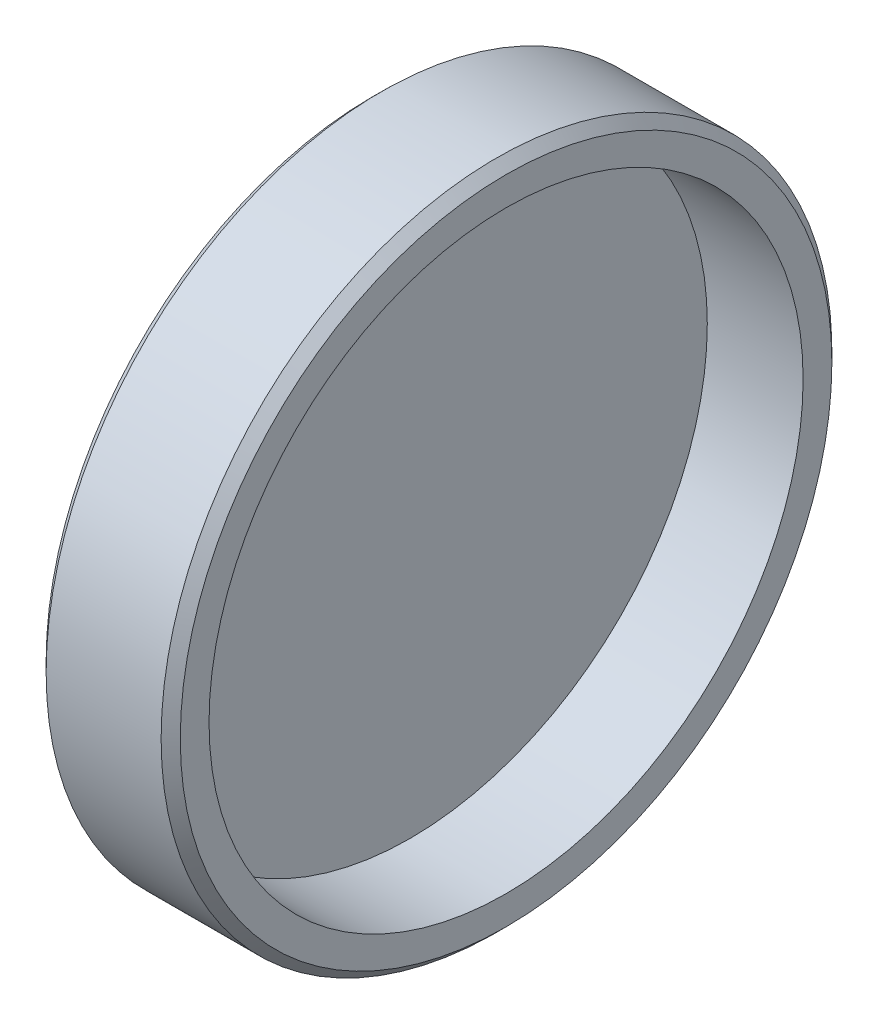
ISO-10303-21;
HEADER;
FILE_DESCRIPTION(('STEP AP214'),'2;1');
FILE_NAME('part.step','',(''),(''),'','','');
FILE_SCHEMA(('AUTOMOTIVE_DESIGN { 1 0 10303 214 1 1 1 1 }'));
ENDSEC;
DATA;
#1=APPLICATION_CONTEXT('core data for automotive mechanical design processes');
#2=APPLICATION_PROTOCOL_DEFINITION('international standard','automotive_design',2000,#1);
#3=PRODUCT_CONTEXT('',#1,'mechanical');
#4=PRODUCT('Part','Part','',(#3));
#5=PRODUCT_RELATED_PRODUCT_CATEGORY('part','',(#4));
#6=PRODUCT_DEFINITION_FORMATION('','',#4);
#7=PRODUCT_DEFINITION_CONTEXT('part definition',#1,'design');
#8=PRODUCT_DEFINITION('design','',#6,#7);
#9=PRODUCT_DEFINITION_SHAPE('','',#8);
#10=(LENGTH_UNIT() NAMED_UNIT(*) SI_UNIT(.MILLI.,.METRE.));
#11=(NAMED_UNIT(*) PLANE_ANGLE_UNIT() SI_UNIT($,.RADIAN.));
#12=(NAMED_UNIT(*) SI_UNIT($,.STERADIAN.) SOLID_ANGLE_UNIT());
#13=UNCERTAINTY_MEASURE_WITH_UNIT(LENGTH_MEASURE(1.E-05),#10,'distance_accuracy_value','');
#14=(GEOMETRIC_REPRESENTATION_CONTEXT(3) GLOBAL_UNCERTAINTY_ASSIGNED_CONTEXT((#13)) GLOBAL_UNIT_ASSIGNED_CONTEXT((#10,
#11,#12)) REPRESENTATION_CONTEXT('',''));
#15=CARTESIAN_POINT('',(0.,0.,0.));
#16=DIRECTION('',(0.,0.,1.));
#17=DIRECTION('',(1.,0.,0.));
#18=AXIS2_PLACEMENT_3D('',#15,#16,#17);
#19=CARTESIAN_POINT('',(0.,0.,0.));
#20=DIRECTION('',(1.,0.,0.));
#21=DIRECTION('',(0.,0.,-1.));
#22=AXIS2_PLACEMENT_3D('',#19,#20,#21);
#23=PLANE('',#22);
#24=CARTESIAN_POINT('',(0.,0.,0.));
#25=DIRECTION('',(1.,0.,0.));
#26=DIRECTION('',(0.,0.,-1.));
#27=AXIS2_PLACEMENT_3D('',#24,#25,#26);
#28=CIRCLE('',#27,17.);
#29=CARTESIAN_POINT('',(0.,0.,-17.));
#30=VERTEX_POINT('',#29);
#31=EDGE_CURVE('E44',#30,#30,#28,.F.);
#32=ORIENTED_EDGE('',*,*,#31,.T.);
#33=EDGE_LOOP('',(#32));
#34=FACE_BOUND('',#33,.T.);
#35=ADVANCED_FACE('F30',(#34),#23,.F.);
#36=CARTESIAN_POINT('',(0.,0.,0.));
#37=DIRECTION('',(-1.,0.,0.));
#38=DIRECTION('',(0.,0.,1.));
#39=AXIS2_PLACEMENT_3D('',#36,#37,#38);
#40=CYLINDRICAL_SURFACE('',#39,17.5);
#41=CARTESIAN_POINT('',(0.500000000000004,0.,0.));
#42=DIRECTION('',(1.,0.,0.));
#43=DIRECTION('',(0.,0.,-1.));
#44=AXIS2_PLACEMENT_3D('',#41,#42,#43);
#45=CIRCLE('',#44,17.5);
#46=CARTESIAN_POINT('',(0.500000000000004,0.,-17.5));
#47=VERTEX_POINT('',#46);
#48=EDGE_CURVE('E36',#47,#47,#45,.T.);
#49=ORIENTED_EDGE('',*,*,#48,.T.);
#50=EDGE_LOOP('',(#49));
#51=FACE_BOUND('',#50,.T.);
#52=CARTESIAN_POINT('',(6.5,0.,0.));
#53=DIRECTION('',(-1.,0.,0.));
#54=DIRECTION('',(0.,0.,1.));
#55=AXIS2_PLACEMENT_3D('',#52,#53,#54);
#56=CIRCLE('',#55,17.5);
#57=CARTESIAN_POINT('',(6.5,0.,17.5));
#58=VERTEX_POINT('',#57);
#59=EDGE_CURVE('E40',#58,#58,#56,.T.);
#60=ORIENTED_EDGE('',*,*,#59,.T.);
#61=EDGE_LOOP('',(#60));
#62=FACE_BOUND('',#61,.T.);
#63=ADVANCED_FACE('F73',(#51,#62),#40,.T.);
#64=CARTESIAN_POINT('',(7.,15.5,0.));
#65=DIRECTION('',(-1.,0.,0.));
#66=DIRECTION('',(0.,0.,1.));
#67=AXIS2_PLACEMENT_3D('',#64,#65,#66);
#68=PLANE('',#67);
#69=CARTESIAN_POINT('',(7.,0.,0.));
#70=DIRECTION('',(-1.,0.,0.));
#71=DIRECTION('',(0.,0.,1.));
#72=AXIS2_PLACEMENT_3D('',#69,#70,#71);
#73=CIRCLE('',#72,17.);
#74=CARTESIAN_POINT('',(7.,0.,17.));
#75=VERTEX_POINT('',#74);
#76=EDGE_CURVE('E10',#75,#75,#73,.F.);
#77=ORIENTED_EDGE('',*,*,#76,.T.);
#78=EDGE_LOOP('',(#77));
#79=FACE_BOUND('',#78,.T.);
#80=CARTESIAN_POINT('',(7.,0.,0.));
#81=DIRECTION('',(-1.,0.,0.));
#82=DIRECTION('',(0.,0.,1.));
#83=AXIS2_PLACEMENT_3D('',#80,#81,#82);
#84=CIRCLE('',#83,15.5);
#85=CARTESIAN_POINT('',(7.,0.,15.5));
#86=VERTEX_POINT('',#85);
#87=EDGE_CURVE('E49',#86,#86,#84,.T.);
#88=ORIENTED_EDGE('',*,*,#87,.T.);
#89=EDGE_LOOP('',(#88));
#90=FACE_BOUND('',#89,.T.);
#91=ADVANCED_FACE('F69',(#79,#90),#68,.F.);
#92=CARTESIAN_POINT('',(0.,0.,0.));
#93=DIRECTION('',(-1.,0.,0.));
#94=DIRECTION('',(0.,0.,1.));
#95=AXIS2_PLACEMENT_3D('',#92,#93,#94);
#96=CYLINDRICAL_SURFACE('',#95,15.5);
#97=ORIENTED_EDGE('',*,*,#87,.F.);
#98=EDGE_LOOP('',(#97));
#99=FACE_BOUND('',#98,.T.);
#100=CARTESIAN_POINT('',(2.,0.,0.));
#101=DIRECTION('',(-1.,0.,0.));
#102=DIRECTION('',(0.,0.,1.));
#103=AXIS2_PLACEMENT_3D('',#100,#101,#102);
#104=CIRCLE('',#103,15.5);
#105=CARTESIAN_POINT('',(2.,0.,15.5));
#106=VERTEX_POINT('',#105);
#107=EDGE_CURVE('E52',#106,#106,#104,.T.);
#108=ORIENTED_EDGE('',*,*,#107,.T.);
#109=EDGE_LOOP('',(#108));
#110=FACE_BOUND('',#109,.T.);
#111=ADVANCED_FACE('F56',(#99,#110),#96,.F.);
#112=CARTESIAN_POINT('',(2.,15.5,0.));
#113=DIRECTION('',(-1.,0.,0.));
#114=DIRECTION('',(0.,0.,1.));
#115=AXIS2_PLACEMENT_3D('',#112,#113,#114);
#116=PLANE('',#115);
#117=ORIENTED_EDGE('',*,*,#107,.F.);
#118=EDGE_LOOP('',(#117));
#119=FACE_BOUND('',#118,.T.);
#120=ADVANCED_FACE('F58',(#119),#116,.F.);
#121=CARTESIAN_POINT('',(0.,0.,0.));
#122=DIRECTION('',(1.,0.,0.));
#123=DIRECTION('',(0.,0.,-1.));
#124=AXIS2_PLACEMENT_3D('',#121,#122,#123);
#125=CONICAL_SURFACE('',#124,17.,0.785398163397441);
#126=ORIENTED_EDGE('',*,*,#48,.F.);
#127=EDGE_LOOP('',(#126));
#128=FACE_BOUND('',#127,.T.);
#129=ORIENTED_EDGE('',*,*,#31,.F.);
#130=EDGE_LOOP('',(#129));
#131=FACE_BOUND('',#130,.T.);
#132=ADVANCED_FACE('F60',(#128,#131),#125,.T.);
#133=CARTESIAN_POINT('',(6.5,0.,0.));
#134=DIRECTION('',(-1.,0.,0.));
#135=DIRECTION('',(0.,0.,1.));
#136=AXIS2_PLACEMENT_3D('',#133,#134,#135);
#137=CONICAL_SURFACE('',#136,17.5,0.785398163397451);
#138=ORIENTED_EDGE('',*,*,#76,.F.);
#139=EDGE_LOOP('',(#138));
#140=FACE_BOUND('',#139,.T.);
#141=ORIENTED_EDGE('',*,*,#59,.F.);
#142=EDGE_LOOP('',(#141));
#143=FACE_BOUND('',#142,.T.);
#144=ADVANCED_FACE('F66',(#140,#143),#137,.T.);
#145=CLOSED_SHELL('',(#35,#63,#91,#111,#120,#132,#144));
#146=MANIFOLD_SOLID_BREP('B2',#145);
#147=ADVANCED_BREP_SHAPE_REPRESENTATION('',(#18,#146),#14);
#148=SHAPE_DEFINITION_REPRESENTATION(#9,#147);
ENDSEC;
END-ISO-10303-21;
